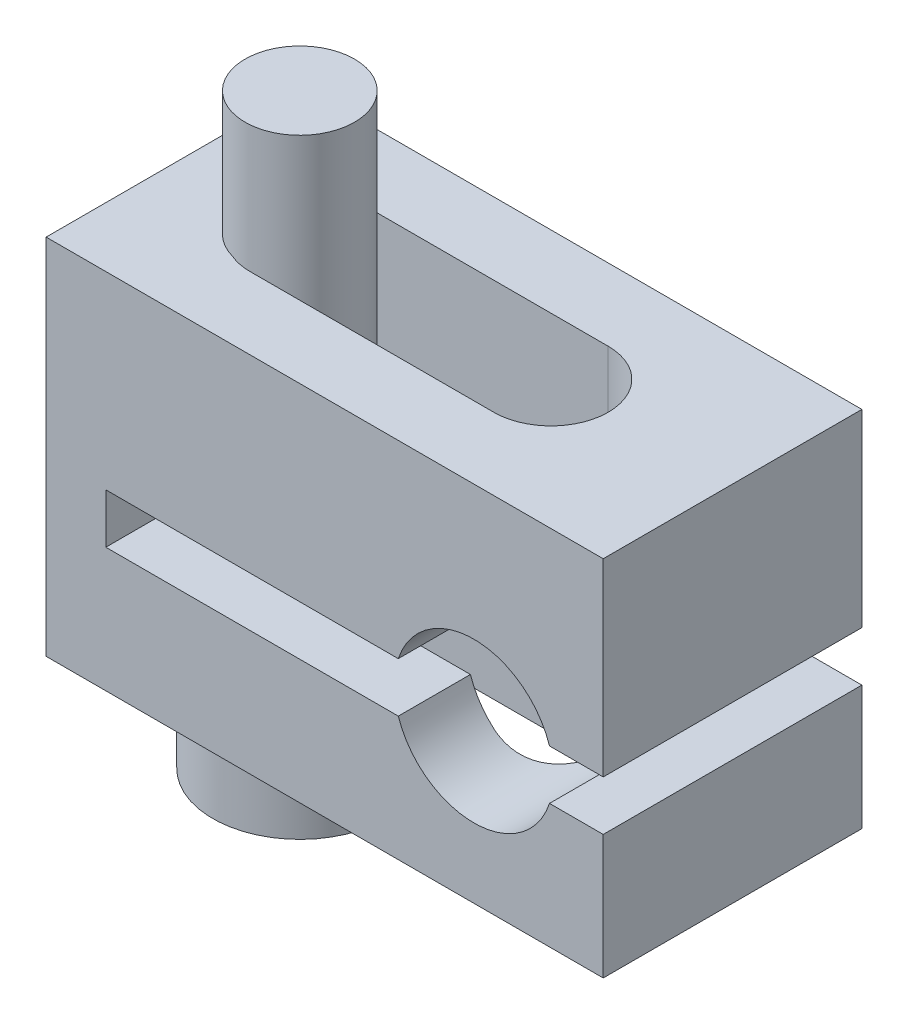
ISO-10303-21;
HEADER;
FILE_DESCRIPTION(('STEP AP214'),'2;1');
FILE_NAME('part.step','',(''),(''),'','','');
FILE_SCHEMA(('AUTOMOTIVE_DESIGN { 1 0 10303 214 1 1 1 1 }'));
ENDSEC;
DATA;
#1=APPLICATION_CONTEXT('core data for automotive mechanical design processes');
#2=APPLICATION_PROTOCOL_DEFINITION('international standard','automotive_design',2000,#1);
#3=PRODUCT_CONTEXT('',#1,'mechanical');
#4=PRODUCT('Part','Part','',(#3));
#5=PRODUCT_RELATED_PRODUCT_CATEGORY('part','',(#4));
#6=PRODUCT_DEFINITION_FORMATION('','',#4);
#7=PRODUCT_DEFINITION_CONTEXT('part definition',#1,'design');
#8=PRODUCT_DEFINITION('design','',#6,#7);
#9=PRODUCT_DEFINITION_SHAPE('','',#8);
#10=(LENGTH_UNIT() NAMED_UNIT(*) SI_UNIT(.MILLI.,.METRE.));
#11=(NAMED_UNIT(*) PLANE_ANGLE_UNIT() SI_UNIT($,.RADIAN.));
#12=(NAMED_UNIT(*) SI_UNIT($,.STERADIAN.) SOLID_ANGLE_UNIT());
#13=UNCERTAINTY_MEASURE_WITH_UNIT(LENGTH_MEASURE(1.E-05),#10,'distance_accuracy_value','');
#14=(GEOMETRIC_REPRESENTATION_CONTEXT(3) GLOBAL_UNCERTAINTY_ASSIGNED_CONTEXT((#13)) GLOBAL_UNIT_ASSIGNED_CONTEXT((#10,
#11,#12)) REPRESENTATION_CONTEXT('',''));
#15=CARTESIAN_POINT('',(0.,0.,0.));
#16=DIRECTION('',(0.,0.,1.));
#17=DIRECTION('',(1.,0.,0.));
#18=AXIS2_PLACEMENT_3D('',#15,#16,#17);
#19=CARTESIAN_POINT('',(2.47650000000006,4.318,-1.4605));
#20=DIRECTION('',(0.,0.,-1.));
#21=DIRECTION('',(-1.,0.,0.));
#22=AXIS2_PLACEMENT_3D('',#19,#20,#21);
#23=PLANE('',#22);
#24=CARTESIAN_POINT('',(3.81000000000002,-1.14300000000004,-1.46050000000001));
#25=DIRECTION('',(0.,0.,1.));
#26=DIRECTION('',(0.,-1.,0.));
#27=AXIS2_PLACEMENT_3D('',#24,#25,#26);
#28=CIRCLE('',#27,2.032);
#29=CARTESIAN_POINT('',(1.87976711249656,-0.507999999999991,-1.46050000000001));
#30=VERTEX_POINT('',#29);
#31=CARTESIAN_POINT('',(2.47650000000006,0.390232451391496,-1.4605));
#32=VERTEX_POINT('',#31);
#33=EDGE_CURVE('E365',#30,#32,#28,.F.);
#34=ORIENTED_EDGE('',*,*,#33,.T.);
#35=DIRECTION('',(0.,-1.,0.));
#36=VECTOR('',#35,1.);
#37=CARTESIAN_POINT('',(2.47650000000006,4.318,-1.46049999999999));
#38=LINE('',#37,#36);
#39=CARTESIAN_POINT('',(2.47650000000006,4.318,-1.4605));
#40=VERTEX_POINT('',#39);
#41=EDGE_CURVE('E206',#32,#40,#38,.F.);
#42=ORIENTED_EDGE('',*,*,#41,.T.);
#43=DIRECTION('',(1.,0.,0.));
#44=VECTOR('',#43,1.);
#45=CARTESIAN_POINT('',(-7.11199999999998,4.318,-1.4605));
#46=LINE('',#45,#44);
#47=CARTESIAN_POINT('',(-3.74649999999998,4.318,-1.4605));
#48=VERTEX_POINT('',#47);
#49=EDGE_CURVE('E439',#48,#40,#46,.T.);
#50=ORIENTED_EDGE('',*,*,#49,.F.);
#51=DIRECTION('',(0.,-1.,0.));
#52=VECTOR('',#51,1.);
#53=CARTESIAN_POINT('',(-3.74649999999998,4.318,-1.46049999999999));
#54=LINE('',#53,#52);
#55=CARTESIAN_POINT('',(-3.74649999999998,-0.507999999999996,-1.4605));
#56=VERTEX_POINT('',#55);
#57=EDGE_CURVE('E205',#48,#56,#54,.T.);
#58=ORIENTED_EDGE('',*,*,#57,.T.);
#59=DIRECTION('',(1.,0.,0.));
#60=VECTOR('',#59,1.);
#61=CARTESIAN_POINT('',(1.8797671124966,-0.507999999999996,-1.46050000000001));
#62=LINE('',#61,#60);
#63=EDGE_CURVE('E383',#30,#56,#62,.F.);
#64=ORIENTED_EDGE('',*,*,#63,.F.);
#65=EDGE_LOOP('',(#34,#42,#50,#58,#64));
#66=FACE_BOUND('',#65,.T.);
#67=ADVANCED_FACE('F17',(#66),#23,.F.);
#68=CARTESIAN_POINT('',(2.47650000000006,4.318,0.));
#69=DIRECTION('',(0.,-1.,0.));
#70=DIRECTION('',(0.,0.,-1.));
#71=AXIS2_PLACEMENT_3D('',#68,#69,#70);
#72=CYLINDRICAL_SURFACE('',#71,1.4605);
#73=CARTESIAN_POINT('',(2.47650000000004,0.390232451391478,-1.46049999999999));
#74=CARTESIAN_POINT('',(2.50555463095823,0.415509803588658,-1.46050207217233));
#75=CARTESIAN_POINT('',(2.53534390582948,0.439959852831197,-1.45963267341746));
#76=CARTESIAN_POINT('',(2.5962057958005,0.487093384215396,-1.45590518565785));
#77=CARTESIAN_POINT('',(2.62727943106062,0.509775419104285,-1.45304548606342));
#78=CARTESIAN_POINT('',(2.69055768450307,0.553275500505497,-1.44508061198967));
#79=CARTESIAN_POINT('',(2.72276500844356,0.57408859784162,-1.43996967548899));
#80=CARTESIAN_POINT('',(2.78792788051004,0.613658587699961,-1.4272972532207));
#81=CARTESIAN_POINT('',(2.82088321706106,0.632416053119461,-1.41973645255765));
#82=CARTESIAN_POINT('',(2.92077758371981,0.685657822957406,-1.3929913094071));
#83=CARTESIAN_POINT('',(2.98845267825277,0.716912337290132,-1.3697765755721));
#84=CARTESIAN_POINT('',(3.12226589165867,0.770437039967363,-1.31200058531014));
#85=CARTESIAN_POINT('',(3.18840724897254,0.792728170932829,-1.2774661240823));
#86=CARTESIAN_POINT('',(3.31096528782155,0.827717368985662,-1.20063972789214));
#87=CARTESIAN_POINT('',(3.36773641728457,0.841041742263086,-1.15919277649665));
#88=CARTESIAN_POINT('',(3.47531586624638,0.861999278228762,-1.06790025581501));
#89=CARTESIAN_POINT('',(3.5261185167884,0.869627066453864,-1.01804680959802));
#90=CARTESIAN_POINT('',(3.62132330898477,0.8808053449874,-0.909819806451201));
#91=CARTESIAN_POINT('',(3.66552285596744,0.884243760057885,-0.85125722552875));
#92=CARTESIAN_POINT('',(3.74469371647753,0.888338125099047,-0.728086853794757));
#93=CARTESIAN_POINT('',(3.7796598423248,0.888992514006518,-0.663475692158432));
#94=CARTESIAN_POINT('',(3.84207606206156,0.889008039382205,-0.524012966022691));
#95=CARTESIAN_POINT('',(3.86862564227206,0.888253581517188,-0.448758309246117));
#96=CARTESIAN_POINT('',(3.90908942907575,0.886684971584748,-0.29503320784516));
#97=CARTESIAN_POINT('',(3.92302794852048,0.885870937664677,-0.216569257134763));
#98=CARTESIAN_POINT('',(3.93266911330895,0.885294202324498,-0.114724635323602));
#99=CARTESIAN_POINT('',(3.93429216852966,0.885195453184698,-0.0918120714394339));
#100=CARTESIAN_POINT('',(3.93645805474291,0.885061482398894,-0.0459363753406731));
#101=CARTESIAN_POINT('',(3.93700090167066,0.885026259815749,-0.0229732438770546));
#102=CARTESIAN_POINT('',(3.93699678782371,0.885031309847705,0.0818370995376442));
#103=CARTESIAN_POINT('',(3.93009275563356,0.885496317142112,0.163791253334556));
#104=CARTESIAN_POINT('',(3.90263419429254,0.886932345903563,0.325508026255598));
#105=CARTESIAN_POINT('',(3.8820477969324,0.887904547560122,0.405265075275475));
#106=CARTESIAN_POINT('',(3.82779059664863,0.889102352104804,0.56017942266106));
#107=CARTESIAN_POINT('',(3.79412638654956,0.889328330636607,0.635339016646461));
#108=CARTESIAN_POINT('',(3.71468713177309,0.887150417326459,0.778895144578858));
#109=CARTESIAN_POINT('',(3.66891788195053,0.884747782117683,0.847294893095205));
#110=CARTESIAN_POINT('',(3.567476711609,0.875107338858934,0.974339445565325));
#111=CARTESIAN_POINT('',(3.51195828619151,0.867940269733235,1.03311151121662));
#112=CARTESIAN_POINT('',(3.39275684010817,0.846617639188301,1.1401462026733));
#113=CARTESIAN_POINT('',(3.32908137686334,0.832468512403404,1.18841844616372));
#114=CARTESIAN_POINT('',(3.20191282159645,0.7969105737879,1.26967310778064));
#115=CARTESIAN_POINT('',(3.13881598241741,0.776176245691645,1.30357226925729));
#116=CARTESIAN_POINT('',(3.01107667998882,0.726607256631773,1.3609518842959));
#117=CARTESIAN_POINT('',(2.94643403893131,0.697771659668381,1.38443113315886));
#118=CARTESIAN_POINT('',(2.82126685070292,0.633560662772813,1.42065551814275));
#119=CARTESIAN_POINT('',(2.76068635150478,0.598529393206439,1.43382802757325));
#120=CARTESIAN_POINT('',(2.64274771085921,0.521778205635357,1.45223333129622));
#121=CARTESIAN_POINT('',(2.58538662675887,0.480064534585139,1.45747349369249));
#122=CARTESIAN_POINT('',(2.51213255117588,0.420688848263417,1.46017998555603));
#123=CARTESIAN_POINT('',(2.49417615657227,0.405611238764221,1.46050185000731));
#124=CARTESIAN_POINT('',(2.47650000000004,0.390232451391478,1.46050000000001));
#125=B_SPLINE_CURVE_WITH_KNOTS('',3,(#73,#74,#75,#76,#77,#78,#79,#80,#81,#82,#83,#84,#85,#86,
#87,#88,#89,#90,#91,#92,#93,#94,#95,#96,#97,#98,#99,#100,#101,#102,#103,#104,#105,#106,#107,
#108,#109,#110,#111,#112,#113,#114,#115,#116,#117,#118,#119,#120,#121,#122,#123,#124),
.UNSPECIFIED.,.F.,.F.,(4,2,2,2,2,2,2,2,2,2,2,2,2,2,2,2,2,2,2,2,2,2,2,2,2,4),(0.,
0.11552441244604,0.231142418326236,0.347058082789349,0.462941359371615,0.69575898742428,
0.92802943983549,1.14165945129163,1.35549075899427,1.57492511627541,1.79448249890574,
2.03284914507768,2.27075525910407,2.33964860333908,2.40854093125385,2.65396781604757,
2.89996834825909,3.14584502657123,3.39160421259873,3.63379368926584,3.87576038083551,
4.09828962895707,4.3208445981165,4.53359358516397,4.74614483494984,4.81646215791),.UNSPECIFIED.);
#126=CARTESIAN_POINT('',(2.47650000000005,0.390232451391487,1.4605));
#127=VERTEX_POINT('',#126);
#128=EDGE_CURVE('E452',#32,#127,#125,.T.);
#129=ORIENTED_EDGE('',*,*,#128,.T.);
#130=DIRECTION('',(0.,1.,0.));
#131=VECTOR('',#130,1.);
#132=CARTESIAN_POINT('',(2.47650000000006,4.318,1.4605));
#133=LINE('',#132,#131);
#134=CARTESIAN_POINT('',(2.47650000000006,4.318,1.4605));
#135=VERTEX_POINT('',#134);
#136=EDGE_CURVE('E209',#127,#135,#133,.T.);
#137=ORIENTED_EDGE('',*,*,#136,.T.);
#138=CARTESIAN_POINT('',(2.47650000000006,4.318,0.));
#139=DIRECTION('',(0.,-1.,0.));
#140=DIRECTION('',(0.,0.,-1.));
#141=AXIS2_PLACEMENT_3D('',#138,#139,#140);
#142=CIRCLE('',#141,1.4605);
#143=EDGE_CURVE('E444',#40,#135,#142,.T.);
#144=ORIENTED_EDGE('',*,*,#143,.F.);
#145=ORIENTED_EDGE('',*,*,#41,.F.);
#146=EDGE_LOOP('',(#129,#137,#144,#145));
#147=FACE_BOUND('',#146,.T.);
#148=ADVANCED_FACE('F458',(#147),#72,.F.);
#149=CARTESIAN_POINT('',(-3.74649999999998,4.318,1.4605));
#150=DIRECTION('',(0.,0.,1.));
#151=DIRECTION('',(1.,0.,0.));
#152=AXIS2_PLACEMENT_3D('',#149,#150,#151);
#153=PLANE('',#152);
#154=DIRECTION('',(0.,-1.,0.));
#155=VECTOR('',#154,1.);
#156=CARTESIAN_POINT('',(-3.74649999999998,4.318,1.46050000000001));
#157=LINE('',#156,#155);
#158=CARTESIAN_POINT('',(-3.74649999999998,-0.507999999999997,1.4605));
#159=VERTEX_POINT('',#158);
#160=CARTESIAN_POINT('',(-3.74649999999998,4.318,1.46050000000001));
#161=VERTEX_POINT('',#160);
#162=EDGE_CURVE('E175',#159,#161,#157,.F.);
#163=ORIENTED_EDGE('',*,*,#162,.T.);
#164=DIRECTION('',(1.,0.,0.));
#165=VECTOR('',#164,1.);
#166=CARTESIAN_POINT('',(-7.11199999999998,4.318,1.4605));
#167=LINE('',#166,#165);
#168=EDGE_CURVE('E510',#135,#161,#167,.F.);
#169=ORIENTED_EDGE('',*,*,#168,.F.);
#170=ORIENTED_EDGE('',*,*,#136,.F.);
#171=CARTESIAN_POINT('',(3.81000000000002,-1.14300000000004,1.4605));
#172=DIRECTION('',(0.,0.,1.));
#173=DIRECTION('',(0.,-1.,0.));
#174=AXIS2_PLACEMENT_3D('',#171,#172,#173);
#175=CIRCLE('',#174,2.032);
#176=CARTESIAN_POINT('',(1.87976711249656,-0.50799999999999,1.4605));
#177=VERTEX_POINT('',#176);
#178=EDGE_CURVE('E415',#127,#177,#175,.T.);
#179=ORIENTED_EDGE('',*,*,#178,.T.);
#180=DIRECTION('',(1.,0.,0.));
#181=VECTOR('',#180,1.);
#182=CARTESIAN_POINT('',(1.8797671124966,-0.507999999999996,1.4605));
#183=LINE('',#182,#181);
#184=EDGE_CURVE('E179',#159,#177,#183,.T.);
#185=ORIENTED_EDGE('',*,*,#184,.F.);
#186=EDGE_LOOP('',(#163,#169,#170,#179,#185));
#187=FACE_BOUND('',#186,.T.);
#188=ADVANCED_FACE('F927',(#187),#153,.F.);
#189=CARTESIAN_POINT('',(-3.74649999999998,4.318,0.));
#190=DIRECTION('',(0.,-1.,0.));
#191=DIRECTION('',(0.,0.,-1.));
#192=AXIS2_PLACEMENT_3D('',#189,#190,#191);
#193=CYLINDRICAL_SURFACE('',#192,1.4605);
#194=CARTESIAN_POINT('',(-3.74649999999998,-0.507999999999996,0.));
#195=DIRECTION('',(0.,-1.,0.));
#196=DIRECTION('',(0.,0.,-1.));
#197=AXIS2_PLACEMENT_3D('',#194,#195,#196);
#198=CIRCLE('',#197,1.4605);
#199=CARTESIAN_POINT('',(-4.31800000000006,-0.507999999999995,-1.34404166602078));
#200=VERTEX_POINT('',#199);
#201=EDGE_CURVE('E185',#56,#200,#198,.F.);
#202=ORIENTED_EDGE('',*,*,#201,.F.);
#203=ORIENTED_EDGE('',*,*,#57,.F.);
#204=CARTESIAN_POINT('',(-3.74649999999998,4.318,0.));
#205=DIRECTION('',(0.,-1.,0.));
#206=DIRECTION('',(0.,0.,-1.));
#207=AXIS2_PLACEMENT_3D('',#204,#205,#206);
#208=CIRCLE('',#207,1.4605);
#209=CARTESIAN_POINT('',(-4.31800000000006,4.318,-1.34404166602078));
#210=VERTEX_POINT('',#209);
#211=EDGE_CURVE('E432',#210,#48,#208,.T.);
#212=ORIENTED_EDGE('',*,*,#211,.F.);
#213=DIRECTION('',(0.,-1.,0.));
#214=VECTOR('',#213,1.);
#215=CARTESIAN_POINT('',(-4.31800000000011,7.49299999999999,-1.34404166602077));
#216=LINE('',#215,#214);
#217=EDGE_CURVE('E201',#200,#210,#216,.F.);
#218=ORIENTED_EDGE('',*,*,#217,.F.);
#219=EDGE_LOOP('',(#202,#203,#212,#218));
#220=FACE_BOUND('',#219,.T.);
#221=ADVANCED_FACE('F938',(#220),#193,.F.);
#222=CARTESIAN_POINT('',(-3.80999999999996,7.49299999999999,0.));
#223=DIRECTION('',(0.,1.,0.));
#224=DIRECTION('',(0.,0.,1.));
#225=AXIS2_PLACEMENT_3D('',#222,#223,#224);
#226=PLANE('',#225);
#227=CARTESIAN_POINT('',(-3.93699999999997,7.49299999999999,0.));
#228=DIRECTION('',(0.,-1.,0.));
#229=DIRECTION('',(0.,0.,-1.));
#230=AXIS2_PLACEMENT_3D('',#227,#228,#229);
#231=CIRCLE('',#230,1.397);
#232=CARTESIAN_POINT('',(-3.93699999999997,7.49299999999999,-1.39699999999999));
#233=VERTEX_POINT('',#232);
#234=EDGE_CURVE('E195',#233,#233,#231,.T.);
#235=ORIENTED_EDGE('',*,*,#234,.F.);
#236=EDGE_LOOP('',(#235));
#237=FACE_BOUND('',#236,.T.);
#238=ADVANCED_FACE('F948',(#237),#226,.T.);
#239=CARTESIAN_POINT('',(-3.74649999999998,4.318,0.));
#240=DIRECTION('',(0.,-1.,0.));
#241=DIRECTION('',(0.,0.,-1.));
#242=AXIS2_PLACEMENT_3D('',#239,#240,#241);
#243=CYLINDRICAL_SURFACE('',#242,1.4605);
#244=CARTESIAN_POINT('',(-3.74649999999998,4.318,0.));
#245=DIRECTION('',(0.,-1.,0.));
#246=DIRECTION('',(0.,0.,-1.));
#247=AXIS2_PLACEMENT_3D('',#244,#245,#246);
#248=CIRCLE('',#247,1.4605);
#249=CARTESIAN_POINT('',(-4.31800000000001,4.318,1.34404166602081));
#250=VERTEX_POINT('',#249);
#251=EDGE_CURVE('E395',#161,#250,#248,.T.);
#252=ORIENTED_EDGE('',*,*,#251,.F.);
#253=ORIENTED_EDGE('',*,*,#162,.F.);
#254=CARTESIAN_POINT('',(-3.74649999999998,-0.507999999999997,0.));
#255=DIRECTION('',(0.,-1.,0.));
#256=DIRECTION('',(0.,0.,-1.));
#257=AXIS2_PLACEMENT_3D('',#254,#255,#256);
#258=CIRCLE('',#257,1.4605);
#259=CARTESIAN_POINT('',(-4.31800000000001,-0.507999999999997,1.3440416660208));
#260=VERTEX_POINT('',#259);
#261=EDGE_CURVE('E21',#260,#159,#258,.F.);
#262=ORIENTED_EDGE('',*,*,#261,.F.);
#263=DIRECTION('',(0.,-1.,0.));
#264=VECTOR('',#263,1.);
#265=CARTESIAN_POINT('',(-4.31800000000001,7.49299999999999,1.34404166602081));
#266=LINE('',#265,#264);
#267=EDGE_CURVE('E173',#250,#260,#266,.T.);
#268=ORIENTED_EDGE('',*,*,#267,.F.);
#269=EDGE_LOOP('',(#252,#253,#262,#268));
#270=FACE_BOUND('',#269,.T.);
#271=ADVANCED_FACE('F171',(#270),#243,.F.);
#272=CARTESIAN_POINT('',(-5.58800000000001,-0.507999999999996,-3.302));
#273=DIRECTION('',(1.,0.,0.));
#274=DIRECTION('',(0.,0.,-1.));
#275=AXIS2_PLACEMENT_3D('',#272,#273,#274);
#276=PLANE('',#275);
#277=DIRECTION('',(0.,1.,0.));
#278=VECTOR('',#277,1.);
#279=CARTESIAN_POINT('',(-5.58800000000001,-0.624782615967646,-3.302));
#280=LINE('',#279,#278);
#281=CARTESIAN_POINT('',(-5.58800000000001,-1.77800000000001,-3.302));
#282=VERTEX_POINT('',#281);
#283=CARTESIAN_POINT('',(-5.58800000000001,-0.507999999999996,-3.302));
#284=VERTEX_POINT('',#283);
#285=EDGE_CURVE('E386',#282,#284,#280,.T.);
#286=ORIENTED_EDGE('',*,*,#285,.T.);
#287=DIRECTION('',(0.,0.,-1.));
#288=VECTOR('',#287,1.);
#289=CARTESIAN_POINT('',(-5.58800000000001,-0.507999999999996,-3.302));
#290=LINE('',#289,#288);
#291=CARTESIAN_POINT('',(-5.58800000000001,-0.507999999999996,3.30199999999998));
#292=VERTEX_POINT('',#291);
#293=EDGE_CURVE('E380',#292,#284,#290,.T.);
#294=ORIENTED_EDGE('',*,*,#293,.F.);
#295=DIRECTION('',(0.,1.,0.));
#296=VECTOR('',#295,1.);
#297=CARTESIAN_POINT('',(-5.58800000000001,-0.624782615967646,3.30199999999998));
#298=LINE('',#297,#296);
#299=CARTESIAN_POINT('',(-5.58800000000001,-1.77800000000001,3.30199999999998));
#300=VERTEX_POINT('',#299);
#301=EDGE_CURVE('E416',#300,#292,#298,.T.);
#302=ORIENTED_EDGE('',*,*,#301,.F.);
#303=DIRECTION('',(0.,0.,1.));
#304=VECTOR('',#303,1.);
#305=CARTESIAN_POINT('',(-5.58800000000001,-1.77800000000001,-3.302));
#306=LINE('',#305,#304);
#307=EDGE_CURVE('E358',#282,#300,#306,.T.);
#308=ORIENTED_EDGE('',*,*,#307,.F.);
#309=EDGE_LOOP('',(#286,#294,#302,#308));
#310=FACE_BOUND('',#309,.T.);
#311=ADVANCED_FACE('F654',(#310),#276,.T.);
#312=CARTESIAN_POINT('',(1.8797671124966,-0.507999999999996,-3.302));
#313=DIRECTION('',(0.,-1.,0.));
#314=DIRECTION('',(0.,0.,-1.));
#315=AXIS2_PLACEMENT_3D('',#312,#313,#314);
#316=PLANE('',#315);
#317=ORIENTED_EDGE('',*,*,#201,.T.);
#318=CARTESIAN_POINT('',(-3.93699999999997,-0.507999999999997,0.));
#319=DIRECTION('',(0.,-1.,0.));
#320=DIRECTION('',(0.,0.,-1.));
#321=AXIS2_PLACEMENT_3D('',#318,#319,#320);
#322=CIRCLE('',#321,1.397);
#323=EDGE_CURVE('E181',#260,#200,#322,.T.);
#324=ORIENTED_EDGE('',*,*,#323,.F.);
#325=ORIENTED_EDGE('',*,*,#261,.T.);
#326=ORIENTED_EDGE('',*,*,#184,.T.);
#327=DIRECTION('',(0.,0.,1.));
#328=VECTOR('',#327,1.);
#329=CARTESIAN_POINT('',(1.87976711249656,-0.507999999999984,-3.302));
#330=LINE('',#329,#328);
#331=CARTESIAN_POINT('',(1.87976711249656,-0.507999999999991,3.30199999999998));
#332=VERTEX_POINT('',#331);
#333=EDGE_CURVE('E379',#177,#332,#330,.T.);
#334=ORIENTED_EDGE('',*,*,#333,.T.);
#335=DIRECTION('',(1.,0.,0.));
#336=VECTOR('',#335,1.);
#337=CARTESIAN_POINT('',(0.168472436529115,-0.507999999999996,3.30199999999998));
#338=LINE('',#337,#336);
#339=EDGE_CURVE('E419',#292,#332,#338,.T.);
#340=ORIENTED_EDGE('',*,*,#339,.F.);
#341=ORIENTED_EDGE('',*,*,#293,.T.);
#342=DIRECTION('',(1.,0.,0.));
#343=VECTOR('',#342,1.);
#344=CARTESIAN_POINT('',(0.168472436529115,-0.507999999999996,-3.302));
#345=LINE('',#344,#343);
#346=CARTESIAN_POINT('',(1.87976711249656,-0.50799999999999,-3.302));
#347=VERTEX_POINT('',#346);
#348=EDGE_CURVE('E389',#284,#347,#345,.T.);
#349=ORIENTED_EDGE('',*,*,#348,.T.);
#350=DIRECTION('',(0.,0.,1.));
#351=VECTOR('',#350,1.);
#352=CARTESIAN_POINT('',(1.87976711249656,-0.507999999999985,-3.302));
#353=LINE('',#352,#351);
#354=EDGE_CURVE('E376',#347,#30,#353,.T.);
#355=ORIENTED_EDGE('',*,*,#354,.T.);
#356=ORIENTED_EDGE('',*,*,#63,.T.);
#357=EDGE_LOOP('',(#317,#324,#325,#326,#334,#340,#341,#349,#355,#356));
#358=FACE_BOUND('',#357,.T.);
#359=ADVANCED_FACE('F182',(#358),#316,.T.);
#360=CARTESIAN_POINT('',(3.81000000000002,-1.14300000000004,-3.302));
#361=DIRECTION('',(0.,0.,1.));
#362=DIRECTION('',(0.,-1.,0.));
#363=AXIS2_PLACEMENT_3D('',#360,#361,#362);
#364=CYLINDRICAL_SURFACE('',#363,2.032);
#365=ORIENTED_EDGE('',*,*,#354,.F.);
#366=CARTESIAN_POINT('',(3.81000000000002,-1.14300000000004,-3.302));
#367=DIRECTION('',(0.,0.,1.));
#368=DIRECTION('',(0.,-1.,0.));
#369=AXIS2_PLACEMENT_3D('',#366,#367,#368);
#370=CIRCLE('',#369,2.032);
#371=CARTESIAN_POINT('',(5.74023288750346,-0.507999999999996,-3.302));
#372=VERTEX_POINT('',#371);
#373=EDGE_CURVE('E546',#347,#372,#370,.F.);
#374=ORIENTED_EDGE('',*,*,#373,.T.);
#375=DIRECTION('',(0.,0.,-1.));
#376=VECTOR('',#375,1.);
#377=CARTESIAN_POINT('',(5.74023288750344,-0.507999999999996,-3.302));
#378=LINE('',#377,#376);
#379=CARTESIAN_POINT('',(5.74023288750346,-0.507999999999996,3.30199999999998));
#380=VERTEX_POINT('',#379);
#381=EDGE_CURVE('E361',#380,#372,#378,.T.);
#382=ORIENTED_EDGE('',*,*,#381,.F.);
#383=CARTESIAN_POINT('',(3.81000000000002,-1.14300000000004,3.30199999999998));
#384=DIRECTION('',(0.,0.,1.));
#385=DIRECTION('',(0.,-1.,0.));
#386=AXIS2_PLACEMENT_3D('',#383,#384,#385);
#387=CIRCLE('',#386,2.032);
#388=EDGE_CURVE('E522',#332,#380,#387,.F.);
#389=ORIENTED_EDGE('',*,*,#388,.F.);
#390=ORIENTED_EDGE('',*,*,#333,.F.);
#391=ORIENTED_EDGE('',*,*,#178,.F.);
#392=ORIENTED_EDGE('',*,*,#128,.F.);
#393=ORIENTED_EDGE('',*,*,#33,.F.);
#394=EDGE_LOOP('',(#365,#374,#382,#389,#390,#391,#392,#393));
#395=FACE_BOUND('',#394,.T.);
#396=ADVANCED_FACE('F462',(#395),#364,.F.);
#397=CARTESIAN_POINT('',(7.11199999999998,-0.507999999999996,-3.302));
#398=DIRECTION('',(0.,-1.,0.));
#399=DIRECTION('',(0.,0.,-1.));
#400=AXIS2_PLACEMENT_3D('',#397,#398,#399);
#401=PLANE('',#400);
#402=DIRECTION('',(1.,0.,0.));
#403=VECTOR('',#402,1.);
#404=CARTESIAN_POINT('',(0.168472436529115,-0.507999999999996,-3.302));
#405=LINE('',#404,#403);
#406=CARTESIAN_POINT('',(7.11199999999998,-0.507999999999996,-3.302));
#407=VERTEX_POINT('',#406);
#408=EDGE_CURVE('E373',#372,#407,#405,.T.);
#409=ORIENTED_EDGE('',*,*,#408,.T.);
#410=DIRECTION('',(0.,0.,-1.));
#411=VECTOR('',#410,1.);
#412=CARTESIAN_POINT('',(7.11199999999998,-0.507999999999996,-3.30199999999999));
#413=LINE('',#412,#411);
#414=CARTESIAN_POINT('',(7.11199999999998,-0.507999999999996,3.30199999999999));
#415=VERTEX_POINT('',#414);
#416=EDGE_CURVE('E364',#415,#407,#413,.T.);
#417=ORIENTED_EDGE('',*,*,#416,.F.);
#418=DIRECTION('',(1.,0.,0.));
#419=VECTOR('',#418,1.);
#420=CARTESIAN_POINT('',(0.168472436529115,-0.507999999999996,3.30199999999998));
#421=LINE('',#420,#419);
#422=EDGE_CURVE('E518',#380,#415,#421,.T.);
#423=ORIENTED_EDGE('',*,*,#422,.F.);
#424=ORIENTED_EDGE('',*,*,#381,.T.);
#425=EDGE_LOOP('',(#409,#417,#423,#424));
#426=FACE_BOUND('',#425,.T.);
#427=ADVANCED_FACE('F467',(#426),#401,.T.);
#428=CARTESIAN_POINT('',(7.11199999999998,4.318,-3.30199999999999));
#429=DIRECTION('',(1.,0.,0.));
#430=DIRECTION('',(0.,0.,-1.));
#431=AXIS2_PLACEMENT_3D('',#428,#429,#430);
#432=PLANE('',#431);
#433=DIRECTION('',(0.,1.,0.));
#434=VECTOR('',#433,1.);
#435=CARTESIAN_POINT('',(7.11199999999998,-0.624782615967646,-3.302));
#436=LINE('',#435,#434);
#437=CARTESIAN_POINT('',(7.11199999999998,4.318,-3.302));
#438=VERTEX_POINT('',#437);
#439=EDGE_CURVE('E215',#407,#438,#436,.T.);
#440=ORIENTED_EDGE('',*,*,#439,.T.);
#441=DIRECTION('',(0.,0.,1.));
#442=VECTOR('',#441,1.);
#443=CARTESIAN_POINT('',(7.11199999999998,4.318,-3.30199999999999));
#444=LINE('',#443,#442);
#445=CARTESIAN_POINT('',(7.11199999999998,4.318,3.30199999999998));
#446=VERTEX_POINT('',#445);
#447=EDGE_CURVE('E368',#446,#438,#444,.F.);
#448=ORIENTED_EDGE('',*,*,#447,.F.);
#449=DIRECTION('',(0.,1.,0.));
#450=VECTOR('',#449,1.);
#451=CARTESIAN_POINT('',(7.11199999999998,-0.624782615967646,3.30199999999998));
#452=LINE('',#451,#450);
#453=EDGE_CURVE('E347',#415,#446,#452,.T.);
#454=ORIENTED_EDGE('',*,*,#453,.F.);
#455=ORIENTED_EDGE('',*,*,#416,.T.);
#456=EDGE_LOOP('',(#440,#448,#454,#455));
#457=FACE_BOUND('',#456,.T.);
#458=ADVANCED_FACE('F472',(#457),#432,.T.);
#459=CARTESIAN_POINT('',(-7.11199999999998,4.318,-3.30199999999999));
#460=DIRECTION('',(0.,1.,0.));
#461=DIRECTION('',(0.,0.,1.));
#462=AXIS2_PLACEMENT_3D('',#459,#460,#461);
#463=PLANE('',#462);
#464=ORIENTED_EDGE('',*,*,#251,.T.);
#465=CARTESIAN_POINT('',(-3.93699999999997,4.318,0.));
#466=DIRECTION('',(0.,-1.,0.));
#467=DIRECTION('',(0.,0.,-1.));
#468=AXIS2_PLACEMENT_3D('',#465,#466,#467);
#469=CIRCLE('',#468,1.397);
#470=EDGE_CURVE('E193',#210,#250,#469,.F.);
#471=ORIENTED_EDGE('',*,*,#470,.F.);
#472=ORIENTED_EDGE('',*,*,#211,.T.);
#473=ORIENTED_EDGE('',*,*,#49,.T.);
#474=ORIENTED_EDGE('',*,*,#143,.T.);
#475=ORIENTED_EDGE('',*,*,#168,.T.);
#476=EDGE_LOOP('',(#464,#471,#472,#473,#474,#475));
#477=FACE_BOUND('',#476,.T.);
#478=DIRECTION('',(1.,0.,0.));
#479=VECTOR('',#478,1.);
#480=CARTESIAN_POINT('',(0.168472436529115,4.318,-3.302));
#481=LINE('',#480,#479);
#482=CARTESIAN_POINT('',(-7.11199999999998,4.318,-3.302));
#483=VERTEX_POINT('',#482);
#484=EDGE_CURVE('E211',#438,#483,#481,.F.);
#485=ORIENTED_EDGE('',*,*,#484,.T.);
#486=DIRECTION('',(0.,0.,1.));
#487=VECTOR('',#486,1.);
#488=CARTESIAN_POINT('',(-7.11199999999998,4.318,-3.302));
#489=LINE('',#488,#487);
#490=CARTESIAN_POINT('',(-7.11199999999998,4.318,3.30199999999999));
#491=VERTEX_POINT('',#490);
#492=EDGE_CURVE('E538',#491,#483,#489,.F.);
#493=ORIENTED_EDGE('',*,*,#492,.F.);
#494=DIRECTION('',(1.,0.,0.));
#495=VECTOR('',#494,1.);
#496=CARTESIAN_POINT('',(0.168472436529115,4.318,3.30199999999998));
#497=LINE('',#496,#495);
#498=EDGE_CURVE('E411',#446,#491,#497,.F.);
#499=ORIENTED_EDGE('',*,*,#498,.F.);
#500=ORIENTED_EDGE('',*,*,#447,.T.);
#501=EDGE_LOOP('',(#485,#493,#499,#500));
#502=FACE_BOUND('',#501,.T.);
#503=ADVANCED_FACE('F476',(#477,#502),#463,.T.);
#504=CARTESIAN_POINT('',(5.74023288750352,-1.77800000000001,-3.302));
#505=DIRECTION('',(0.,1.,0.));
#506=DIRECTION('',(0.,0.,1.));
#507=AXIS2_PLACEMENT_3D('',#504,#505,#506);
#508=PLANE('',#507);
#509=DIRECTION('',(1.,0.,0.));
#510=VECTOR('',#509,1.);
#511=CARTESIAN_POINT('',(0.168472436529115,-1.77800000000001,-3.302));
#512=LINE('',#511,#510);
#513=CARTESIAN_POINT('',(7.11199999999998,-1.77800000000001,-3.302));
#514=VERTEX_POINT('',#513);
#515=CARTESIAN_POINT('',(5.7402328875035,-1.778,-3.302));
#516=VERTEX_POINT('',#515);
#517=EDGE_CURVE('E557',#514,#516,#512,.F.);
#518=ORIENTED_EDGE('',*,*,#517,.T.);
#519=DIRECTION('',(0.,0.,1.));
#520=VECTOR('',#519,1.);
#521=CARTESIAN_POINT('',(5.74023288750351,-1.778,-3.302));
#522=LINE('',#521,#520);
#523=CARTESIAN_POINT('',(5.7402328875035,-1.778,3.30199999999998));
#524=VERTEX_POINT('',#523);
#525=EDGE_CURVE('E357',#516,#524,#522,.T.);
#526=ORIENTED_EDGE('',*,*,#525,.T.);
#527=DIRECTION('',(1.,0.,0.));
#528=VECTOR('',#527,1.);
#529=CARTESIAN_POINT('',(0.168472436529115,-1.77800000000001,3.30199999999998));
#530=LINE('',#529,#528);
#531=CARTESIAN_POINT('',(7.11199999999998,-1.77800000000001,3.30199999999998));
#532=VERTEX_POINT('',#531);
#533=EDGE_CURVE('E429',#532,#524,#530,.F.);
#534=ORIENTED_EDGE('',*,*,#533,.F.);
#535=DIRECTION('',(0.,0.,-1.));
#536=VECTOR('',#535,1.);
#537=CARTESIAN_POINT('',(7.11199999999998,-1.77800000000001,-3.302));
#538=LINE('',#537,#536);
#539=EDGE_CURVE('E399',#514,#532,#538,.F.);
#540=ORIENTED_EDGE('',*,*,#539,.F.);
#541=EDGE_LOOP('',(#518,#526,#534,#540));
#542=FACE_BOUND('',#541,.T.);
#543=ADVANCED_FACE('F480',(#542),#508,.T.);
#544=CARTESIAN_POINT('',(-5.58800000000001,-1.77800000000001,-3.302));
#545=DIRECTION('',(0.,1.,0.));
#546=DIRECTION('',(0.,0.,1.));
#547=AXIS2_PLACEMENT_3D('',#544,#545,#546);
#548=PLANE('',#547);
#549=CARTESIAN_POINT('',(-3.74649999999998,-1.77800000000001,0.));
#550=DIRECTION('',(0.,-1.,0.));
#551=DIRECTION('',(0.,0.,-1.));
#552=AXIS2_PLACEMENT_3D('',#549,#550,#551);
#553=CIRCLE('',#552,1.4605);
#554=CARTESIAN_POINT('',(-3.74649999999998,-1.77800000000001,1.4605));
#555=VERTEX_POINT('',#554);
#556=CARTESIAN_POINT('',(-4.31799999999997,-1.77800000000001,1.34404166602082));
#557=VERTEX_POINT('',#556);
#558=EDGE_CURVE('E348',#555,#557,#553,.T.);
#559=ORIENTED_EDGE('',*,*,#558,.T.);
#560=CARTESIAN_POINT('',(-3.93699999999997,-1.77800000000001,0.));
#561=DIRECTION('',(0.,-1.,0.));
#562=DIRECTION('',(0.,0.,-1.));
#563=AXIS2_PLACEMENT_3D('',#560,#561,#562);
#564=CIRCLE('',#563,1.397);
#565=CARTESIAN_POINT('',(-4.31799999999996,-1.77800000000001,-1.34404166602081));
#566=VERTEX_POINT('',#565);
#567=EDGE_CURVE('E189',#566,#557,#564,.F.);
#568=ORIENTED_EDGE('',*,*,#567,.F.);
#569=CARTESIAN_POINT('',(-3.74649999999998,-1.77800000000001,0.));
#570=DIRECTION('',(0.,-1.,0.));
#571=DIRECTION('',(0.,0.,-1.));
#572=AXIS2_PLACEMENT_3D('',#569,#570,#571);
#573=CIRCLE('',#572,1.4605);
#574=CARTESIAN_POINT('',(-3.74649999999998,-1.77800000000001,-1.4605));
#575=VERTEX_POINT('',#574);
#576=EDGE_CURVE('E351',#566,#575,#573,.T.);
#577=ORIENTED_EDGE('',*,*,#576,.T.);
#578=DIRECTION('',(-1.,0.,0.));
#579=VECTOR('',#578,1.);
#580=CARTESIAN_POINT('',(2.47650000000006,-1.77800000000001,-1.4605));
#581=LINE('',#580,#579);
#582=CARTESIAN_POINT('',(1.87976711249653,-1.778,-1.46050000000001));
#583=VERTEX_POINT('',#582);
#584=EDGE_CURVE('E243',#575,#583,#581,.F.);
#585=ORIENTED_EDGE('',*,*,#584,.T.);
#586=DIRECTION('',(0.,0.,1.));
#587=VECTOR('',#586,1.);
#588=CARTESIAN_POINT('',(1.87976711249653,-1.778,-3.302));
#589=LINE('',#588,#587);
#590=CARTESIAN_POINT('',(1.87976711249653,-1.778,-3.302));
#591=VERTEX_POINT('',#590);
#592=EDGE_CURVE('E355',#583,#591,#589,.F.);
#593=ORIENTED_EDGE('',*,*,#592,.T.);
#594=DIRECTION('',(1.,0.,0.));
#595=VECTOR('',#594,1.);
#596=CARTESIAN_POINT('',(0.168472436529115,-1.77800000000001,-3.302));
#597=LINE('',#596,#595);
#598=EDGE_CURVE('E390',#591,#282,#597,.F.);
#599=ORIENTED_EDGE('',*,*,#598,.T.);
#600=ORIENTED_EDGE('',*,*,#307,.T.);
#601=DIRECTION('',(1.,0.,0.));
#602=VECTOR('',#601,1.);
#603=CARTESIAN_POINT('',(0.168472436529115,-1.77800000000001,3.30199999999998));
#604=LINE('',#603,#602);
#605=CARTESIAN_POINT('',(1.87976711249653,-1.778,3.30199999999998));
#606=VERTEX_POINT('',#605);
#607=EDGE_CURVE('E420',#606,#300,#604,.F.);
#608=ORIENTED_EDGE('',*,*,#607,.F.);
#609=DIRECTION('',(0.,0.,1.));
#610=VECTOR('',#609,1.);
#611=CARTESIAN_POINT('',(1.87976711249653,-1.778,-3.302));
#612=LINE('',#611,#610);
#613=CARTESIAN_POINT('',(1.87976711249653,-1.778,1.4605));
#614=VERTEX_POINT('',#613);
#615=EDGE_CURVE('E359',#606,#614,#612,.F.);
#616=ORIENTED_EDGE('',*,*,#615,.T.);
#617=DIRECTION('',(1.,0.,0.));
#618=VECTOR('',#617,1.);
#619=CARTESIAN_POINT('',(-3.74649999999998,-1.77800000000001,1.4605));
#620=LINE('',#619,#618);
#621=EDGE_CURVE('E344',#614,#555,#620,.F.);
#622=ORIENTED_EDGE('',*,*,#621,.T.);
#623=EDGE_LOOP('',(#559,#568,#577,#585,#593,#599,#600,#608,#616,#622));
#624=FACE_BOUND('',#623,.T.);
#625=ADVANCED_FACE('F482',(#624),#548,.T.);
#626=CARTESIAN_POINT('',(3.81000000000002,-1.14300000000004,-3.302));
#627=DIRECTION('',(0.,0.,1.));
#628=DIRECTION('',(0.,-1.,0.));
#629=AXIS2_PLACEMENT_3D('',#626,#627,#628);
#630=CYLINDRICAL_SURFACE('',#629,2.032);
#631=ORIENTED_EDGE('',*,*,#615,.F.);
#632=CARTESIAN_POINT('',(3.81000000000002,-1.14300000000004,3.30199999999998));
#633=DIRECTION('',(0.,0.,1.));
#634=DIRECTION('',(0.,-1.,0.));
#635=AXIS2_PLACEMENT_3D('',#632,#633,#634);
#636=CIRCLE('',#635,2.032);
#637=EDGE_CURVE('E531',#524,#606,#636,.F.);
#638=ORIENTED_EDGE('',*,*,#637,.F.);
#639=ORIENTED_EDGE('',*,*,#525,.F.);
#640=CARTESIAN_POINT('',(3.81000000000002,-1.14300000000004,-3.302));
#641=DIRECTION('',(0.,0.,1.));
#642=DIRECTION('',(0.,-1.,0.));
#643=AXIS2_PLACEMENT_3D('',#640,#641,#642);
#644=CIRCLE('',#643,2.032);
#645=EDGE_CURVE('E554',#516,#591,#644,.F.);
#646=ORIENTED_EDGE('',*,*,#645,.T.);
#647=ORIENTED_EDGE('',*,*,#592,.F.);
#648=CARTESIAN_POINT('',(3.81000000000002,-1.14300000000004,-1.46050000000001));
#649=DIRECTION('',(0.,0.,1.));
#650=DIRECTION('',(0.,-1.,0.));
#651=AXIS2_PLACEMENT_3D('',#648,#649,#650);
#652=CIRCLE('',#651,2.032);
#653=CARTESIAN_POINT('',(2.47650000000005,-2.67623245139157,-1.4605));
#654=VERTEX_POINT('',#653);
#655=EDGE_CURVE('E239',#583,#654,#652,.T.);
#656=ORIENTED_EDGE('',*,*,#655,.T.);
#657=CARTESIAN_POINT('',(2.47650000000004,-2.67623245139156,-1.46049999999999));
#658=CARTESIAN_POINT('',(2.50555463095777,-2.70150980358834,-1.46050207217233));
#659=CARTESIAN_POINT('',(2.53534390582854,-2.72595985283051,-1.45963267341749));
#660=CARTESIAN_POINT('',(2.59620579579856,-2.77309338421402,-1.455905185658));
#661=CARTESIAN_POINT('',(2.62727943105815,-2.79577541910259,-1.45304548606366));
#662=CARTESIAN_POINT('',(2.69055768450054,-2.83927550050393,-1.44508061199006));
#663=CARTESIAN_POINT('',(2.72276500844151,-2.86008859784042,-1.43996967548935));
#664=CARTESIAN_POINT('',(2.787927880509,-2.89965858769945,-1.42729725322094));
#665=CARTESIAN_POINT('',(2.82088321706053,-2.91841605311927,-1.41973645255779));
#666=CARTESIAN_POINT('',(2.92077758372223,-2.97165782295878,-1.39299130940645));
#667=CARTESIAN_POINT('',(2.98845267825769,-3.00291233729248,-1.36977657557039));
#668=CARTESIAN_POINT('',(3.12226589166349,-3.05643703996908,-1.31200058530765));
#669=CARTESIAN_POINT('',(3.18840724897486,-3.07872817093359,-1.27746612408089));
#670=CARTESIAN_POINT('',(3.31096528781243,-3.11371736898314,-1.20063972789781));
#671=CARTESIAN_POINT('',(3.36773641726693,-3.12704174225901,-1.15919277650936));
#672=CARTESIAN_POINT('',(3.47531586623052,-3.14799927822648,-1.06790025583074));
#673=CARTESIAN_POINT('',(3.52611851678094,-3.15562706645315,-1.01804680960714));
#674=CARTESIAN_POINT('',(3.62132330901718,-3.16680534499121,-0.909819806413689));
#675=CARTESIAN_POINT('',(3.66552285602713,-3.17024376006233,-0.85125722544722));
#676=CARTESIAN_POINT('',(3.74469371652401,-3.17433812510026,-0.728086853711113));
#677=CARTESIAN_POINT('',(3.77965984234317,-3.17499251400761,-0.663475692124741));
#678=CARTESIAN_POINT('',(3.84207606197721,-3.17500803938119,-0.5240129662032));
#679=CARTESIAN_POINT('',(3.8686256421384,-3.17425358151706,-0.448758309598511));
#680=CARTESIAN_POINT('',(3.90908942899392,-3.17268497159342,-0.295033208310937));
#681=CARTESIAN_POINT('',(3.92302794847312,-3.17187093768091,-0.216569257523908));
#682=CARTESIAN_POINT('',(3.93266912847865,-3.17129420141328,-0.11472447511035));
#683=CARTESIAN_POINT('',(3.9342921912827,-3.17119545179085,-0.0918117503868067));
#684=CARTESIAN_POINT('',(3.93645807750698,-3.17106148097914,-0.0459357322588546));
#685=CARTESIAN_POINT('',(3.93700091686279,-3.17102625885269,-0.0229724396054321));
#686=CARTESIAN_POINT('',(3.93699673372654,-3.17103131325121,0.0818380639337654));
#687=CARTESIAN_POINT('',(3.93009264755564,-3.17149632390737,0.163792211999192));
#688=CARTESIAN_POINT('',(3.90263398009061,-3.17293235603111,0.32550896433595));
#689=CARTESIAN_POINT('',(3.88204753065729,-3.17390455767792,0.40526599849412));
#690=CARTESIAN_POINT('',(3.82779022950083,-3.17510235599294,0.560180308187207));
#691=CARTESIAN_POINT('',(3.79412597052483,-3.17532832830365,0.635339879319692));
#692=CARTESIAN_POINT('',(3.71468662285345,-3.17315039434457,0.778895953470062));
#693=CARTESIAN_POINT('',(3.66891732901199,-3.17074774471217,0.847295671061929));
#694=CARTESIAN_POINT('',(3.56747608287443,-3.16110726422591,0.97434014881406));
#695=CARTESIAN_POINT('',(3.51195762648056,-3.15394017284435,1.03311217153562));
#696=CARTESIAN_POINT('',(3.39275613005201,-3.13261749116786,1.14014677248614));
#697=CARTESIAN_POINT('',(3.32908064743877,-3.11846833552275,1.18841896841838));
#698=CARTESIAN_POINT('',(3.20191207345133,-3.08291033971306,1.26967353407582));
#699=CARTESIAN_POINT('',(3.1388152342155,-3.06217598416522,1.30357264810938));
#700=CARTESIAN_POINT('',(3.01107594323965,-3.01260694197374,1.36095217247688));
#701=CARTESIAN_POINT('',(2.94643331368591,-2.98377131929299,1.38443137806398));
#702=CARTESIAN_POINT('',(2.82126614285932,-2.91956026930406,1.42065568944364));
#703=CARTESIAN_POINT('',(2.76068564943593,-2.8845289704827,1.433828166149));
#704=CARTESIAN_POINT('',(2.64274702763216,-2.80777772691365,1.45223340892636));
#705=CARTESIAN_POINT('',(2.58538595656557,-2.76606402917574,1.45747354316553));
#706=CARTESIAN_POINT('',(2.51213212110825,-2.70668848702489,1.46017999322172));
#707=CARTESIAN_POINT('',(2.49417594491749,-2.6916110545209,1.46050184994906));
#708=CARTESIAN_POINT('',(2.47650000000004,-2.67623245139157,1.46050000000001));
#709=B_SPLINE_CURVE_WITH_KNOTS('',3,(#657,#658,#659,#660,#661,#662,#663,#664,#665,#666,#667,
#668,#669,#670,#671,#672,#673,#674,#675,#676,#677,#678,#679,#680,#681,#682,#683,#684,#685,#686,
#687,#688,#689,#690,#691,#692,#693,#694,#695,#696,#697,#698,#699,#700,#701,#702,#703,#704,#705,
#706,#707,#708),.UNSPECIFIED.,.F.,.F.,(4,2,2,2,2,2,2,2,2,2,2,2,2,2,2,2,2,2,2,2,2,2,2,2,2,4),(0.,
0.115524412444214,0.231142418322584,0.347058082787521,0.462941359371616,0.695758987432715,
0.928029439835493,1.14165945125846,1.35549075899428,1.57492511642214,1.79448249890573,
2.03284914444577,2.27075525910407,2.33964908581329,2.40854189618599,2.65396877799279,
2.89996930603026,3.14584598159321,3.39160516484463,3.63379461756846,3.87576128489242,
4.0982904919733,4.32084542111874,4.53359441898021,4.74614567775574,4.81646215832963),.UNSPECIFIED.);
#710=CARTESIAN_POINT('',(2.47650000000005,-2.67623245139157,1.4605));
#711=VERTEX_POINT('',#710);
#712=EDGE_CURVE('E244',#654,#711,#709,.T.);
#713=ORIENTED_EDGE('',*,*,#712,.T.);
#714=CARTESIAN_POINT('',(3.81000000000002,-1.14300000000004,1.4605));
#715=DIRECTION('',(0.,0.,1.));
#716=DIRECTION('',(0.,-1.,0.));
#717=AXIS2_PLACEMENT_3D('',#714,#715,#716);
#718=CIRCLE('',#717,2.032);
#719=EDGE_CURVE('E253',#711,#614,#718,.F.);
#720=ORIENTED_EDGE('',*,*,#719,.T.);
#721=EDGE_LOOP('',(#631,#638,#639,#646,#647,#656,#713,#720));
#722=FACE_BOUND('',#721,.T.);
#723=ADVANCED_FACE('F255',(#722),#630,.F.);
#724=CARTESIAN_POINT('',(-3.93699999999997,-5.96900000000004,0.));
#725=DIRECTION('',(0.,1.,0.));
#726=DIRECTION('',(0.,0.,1.));
#727=AXIS2_PLACEMENT_3D('',#724,#725,#726);
#728=PLANE('',#727);
#729=DIRECTION('',(-1.,0.,0.));
#730=VECTOR('',#729,1.);
#731=CARTESIAN_POINT('',(-4.57199999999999,-5.96900000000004,-1.09985226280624));
#732=LINE('',#731,#730);
#733=CARTESIAN_POINT('',(-4.57199999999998,-5.96900000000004,-1.09985226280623));
#734=VERTEX_POINT('',#733);
#735=CARTESIAN_POINT('',(-3.30199999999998,-5.96900000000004,-1.09985226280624));
#736=VERTEX_POINT('',#735);
#737=EDGE_CURVE('E242',#734,#736,#732,.F.);
#738=ORIENTED_EDGE('',*,*,#737,.T.);
#739=DIRECTION('',(-0.500000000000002,0.,-0.866025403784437));
#740=VECTOR('',#739,1.);
#741=CARTESIAN_POINT('',(-3.30199999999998,-5.96900000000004,-1.09985226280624));
#742=LINE('',#741,#740);
#743=CARTESIAN_POINT('',(-2.66699999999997,-5.96900000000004,0.));
#744=VERTEX_POINT('',#743);
#745=EDGE_CURVE('E569',#736,#744,#742,.F.);
#746=ORIENTED_EDGE('',*,*,#745,.T.);
#747=DIRECTION('',(0.5,0.,-0.866025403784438));
#748=VECTOR('',#747,1.);
#749=CARTESIAN_POINT('',(-2.66699999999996,-5.96900000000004,0.));
#750=LINE('',#749,#748);
#751=CARTESIAN_POINT('',(-3.30199999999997,-5.96900000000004,1.09985226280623));
#752=VERTEX_POINT('',#751);
#753=EDGE_CURVE('E575',#744,#752,#750,.F.);
#754=ORIENTED_EDGE('',*,*,#753,.T.);
#755=DIRECTION('',(1.,0.,0.));
#756=VECTOR('',#755,1.);
#757=CARTESIAN_POINT('',(-3.30199999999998,-5.96900000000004,1.09985226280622));
#758=LINE('',#757,#756);
#759=CARTESIAN_POINT('',(-4.57199999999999,-5.96900000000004,1.09985226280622));
#760=VERTEX_POINT('',#759);
#761=EDGE_CURVE('E581',#752,#760,#758,.F.);
#762=ORIENTED_EDGE('',*,*,#761,.T.);
#763=DIRECTION('',(0.5,0.,0.866025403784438));
#764=VECTOR('',#763,1.);
#765=CARTESIAN_POINT('',(-4.57199999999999,-5.96900000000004,1.09985226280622));
#766=LINE('',#765,#764);
#767=CARTESIAN_POINT('',(-5.20699999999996,-5.96900000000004,0.));
#768=VERTEX_POINT('',#767);
#769=EDGE_CURVE('E587',#760,#768,#766,.F.);
#770=ORIENTED_EDGE('',*,*,#769,.T.);
#771=DIRECTION('',(-0.5,0.,0.866025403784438));
#772=VECTOR('',#771,1.);
#773=CARTESIAN_POINT('',(-5.20699999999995,-5.96900000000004,0.));
#774=LINE('',#773,#772);
#775=EDGE_CURVE('E593',#768,#734,#774,.F.);
#776=ORIENTED_EDGE('',*,*,#775,.T.);
#777=EDGE_LOOP('',(#738,#746,#754,#762,#770,#776));
#778=FACE_BOUND('',#777,.T.);
#779=ADVANCED_FACE('F489',(#778),#728,.F.);
#780=CARTESIAN_POINT('',(-3.74649999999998,-1.77800000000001,0.));
#781=DIRECTION('',(0.,-1.,0.));
#782=DIRECTION('',(0.,0.,-1.));
#783=AXIS2_PLACEMENT_3D('',#780,#781,#782);
#784=CYLINDRICAL_SURFACE('',#783,1.4605);
#785=CARTESIAN_POINT('',(-3.74649999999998,-4.95299999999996,0.));
#786=DIRECTION('',(0.,-1.,0.));
#787=DIRECTION('',(0.,0.,-1.));
#788=AXIS2_PLACEMENT_3D('',#785,#786,#787);
#789=CIRCLE('',#788,1.4605);
#790=CARTESIAN_POINT('',(-3.74649999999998,-4.95299999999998,-1.4605));
#791=VERTEX_POINT('',#790);
#792=CARTESIAN_POINT('',(-4.31799999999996,-4.95300000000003,-1.34404166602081));
#793=VERTEX_POINT('',#792);
#794=EDGE_CURVE('E235',#791,#793,#789,.F.);
#795=ORIENTED_EDGE('',*,*,#794,.F.);
#796=DIRECTION('',(0.,1.,0.));
#797=VECTOR('',#796,1.);
#798=CARTESIAN_POINT('',(-3.74649999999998,4.318,-1.4605));
#799=LINE('',#798,#797);
#800=EDGE_CURVE('E352',#791,#575,#799,.T.);
#801=ORIENTED_EDGE('',*,*,#800,.T.);
#802=ORIENTED_EDGE('',*,*,#576,.F.);
#803=DIRECTION('',(0.,-1.,0.));
#804=VECTOR('',#803,1.);
#805=CARTESIAN_POINT('',(-4.31799999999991,7.49299999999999,-1.34404166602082));
#806=LINE('',#805,#804);
#807=EDGE_CURVE('E203',#793,#566,#806,.F.);
#808=ORIENTED_EDGE('',*,*,#807,.F.);
#809=EDGE_LOOP('',(#795,#801,#802,#808));
#810=FACE_BOUND('',#809,.T.);
#811=ADVANCED_FACE('F506',(#810),#784,.F.);
#812=CARTESIAN_POINT('',(-3.93699999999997,7.49299999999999,0.));
#813=DIRECTION('',(0.,-1.,0.));
#814=DIRECTION('',(0.,0.,-1.));
#815=AXIS2_PLACEMENT_3D('',#812,#813,#814);
#816=CYLINDRICAL_SURFACE('',#815,1.397);
#817=ORIENTED_EDGE('',*,*,#234,.T.);
#818=EDGE_LOOP('',(#817));
#819=FACE_BOUND('',#818,.T.);
#820=ORIENTED_EDGE('',*,*,#217,.T.);
#821=ORIENTED_EDGE('',*,*,#470,.T.);
#822=ORIENTED_EDGE('',*,*,#267,.T.);
#823=ORIENTED_EDGE('',*,*,#323,.T.);
#824=EDGE_LOOP('',(#820,#821,#822,#823));
#825=FACE_BOUND('',#824,.T.);
#826=DIRECTION('',(0.,-1.,0.));
#827=VECTOR('',#826,1.);
#828=CARTESIAN_POINT('',(-4.31799999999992,4.318,1.34404166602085));
#829=LINE('',#828,#827);
#830=CARTESIAN_POINT('',(-4.31799999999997,-4.953,1.34404166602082));
#831=VERTEX_POINT('',#830);
#832=EDGE_CURVE('E345',#557,#831,#829,.T.);
#833=ORIENTED_EDGE('',*,*,#832,.T.);
#834=CARTESIAN_POINT('',(-3.93699999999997,-4.953,0.));
#835=DIRECTION('',(0.,-1.,0.));
#836=DIRECTION('',(0.,0.,-1.));
#837=AXIS2_PLACEMENT_3D('',#834,#835,#836);
#838=CIRCLE('',#837,1.397);
#839=EDGE_CURVE('E232',#793,#831,#838,.T.);
#840=ORIENTED_EDGE('',*,*,#839,.F.);
#841=ORIENTED_EDGE('',*,*,#807,.T.);
#842=ORIENTED_EDGE('',*,*,#567,.T.);
#843=EDGE_LOOP('',(#833,#840,#841,#842));
#844=FACE_BOUND('',#843,.T.);
#845=ADVANCED_FACE('F191',(#819,#825,#844),#816,.T.);
#846=CARTESIAN_POINT('',(-3.74649999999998,-1.77800000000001,0.));
#847=DIRECTION('',(0.,-1.,0.));
#848=DIRECTION('',(0.,0.,-1.));
#849=AXIS2_PLACEMENT_3D('',#846,#847,#848);
#850=CYLINDRICAL_SURFACE('',#849,1.4605);
#851=ORIENTED_EDGE('',*,*,#558,.F.);
#852=DIRECTION('',(0.,1.,0.));
#853=VECTOR('',#852,1.);
#854=CARTESIAN_POINT('',(-3.74649999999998,4.318,1.4605));
#855=LINE('',#854,#853);
#856=CARTESIAN_POINT('',(-3.74649999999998,-4.953,1.4605));
#857=VERTEX_POINT('',#856);
#858=EDGE_CURVE('E342',#555,#857,#855,.F.);
#859=ORIENTED_EDGE('',*,*,#858,.T.);
#860=CARTESIAN_POINT('',(-3.74649999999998,-4.953,0.));
#861=DIRECTION('',(0.,-1.,0.));
#862=DIRECTION('',(0.,0.,-1.));
#863=AXIS2_PLACEMENT_3D('',#860,#861,#862);
#864=CIRCLE('',#863,1.4605);
#865=EDGE_CURVE('E228',#831,#857,#864,.F.);
#866=ORIENTED_EDGE('',*,*,#865,.F.);
#867=ORIENTED_EDGE('',*,*,#832,.F.);
#868=EDGE_LOOP('',(#851,#859,#866,#867));
#869=FACE_BOUND('',#868,.T.);
#870=ADVANCED_FACE('F502',(#869),#850,.F.);
#871=CARTESIAN_POINT('',(0.168472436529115,-0.624782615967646,3.30199999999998));
#872=DIRECTION('',(0.,0.,1.));
#873=DIRECTION('',(1.,0.,0.));
#874=AXIS2_PLACEMENT_3D('',#871,#872,#873);
#875=PLANE('',#874);
#876=ORIENTED_EDGE('',*,*,#388,.T.);
#877=ORIENTED_EDGE('',*,*,#422,.T.);
#878=ORIENTED_EDGE('',*,*,#453,.T.);
#879=ORIENTED_EDGE('',*,*,#498,.T.);
#880=DIRECTION('',(0.,1.,0.));
#881=VECTOR('',#880,1.);
#882=CARTESIAN_POINT('',(-7.11199999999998,-4.953,3.30199999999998));
#883=LINE('',#882,#881);
#884=CARTESIAN_POINT('',(-7.11199999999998,-4.953,3.30199999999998));
#885=VERTEX_POINT('',#884);
#886=EDGE_CURVE('E521',#885,#491,#883,.T.);
#887=ORIENTED_EDGE('',*,*,#886,.F.);
#888=DIRECTION('',(1.,0.,0.));
#889=VECTOR('',#888,1.);
#890=CARTESIAN_POINT('',(7.11199999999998,-4.953,3.30199999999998));
#891=LINE('',#890,#889);
#892=CARTESIAN_POINT('',(7.11199999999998,-4.953,3.30199999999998));
#893=VERTEX_POINT('',#892);
#894=EDGE_CURVE('E601',#893,#885,#891,.F.);
#895=ORIENTED_EDGE('',*,*,#894,.F.);
#896=DIRECTION('',(0.,1.,0.));
#897=VECTOR('',#896,1.);
#898=CARTESIAN_POINT('',(7.11199999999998,-1.77800000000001,3.30199999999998));
#899=LINE('',#898,#897);
#900=EDGE_CURVE('E214',#532,#893,#899,.F.);
#901=ORIENTED_EDGE('',*,*,#900,.F.);
#902=ORIENTED_EDGE('',*,*,#533,.T.);
#903=ORIENTED_EDGE('',*,*,#637,.T.);
#904=ORIENTED_EDGE('',*,*,#607,.T.);
#905=ORIENTED_EDGE('',*,*,#301,.T.);
#906=ORIENTED_EDGE('',*,*,#339,.T.);
#907=EDGE_LOOP('',(#876,#877,#878,#879,#887,#895,#901,#902,#903,#904,#905,#906));
#908=FACE_BOUND('',#907,.T.);
#909=ADVANCED_FACE('F626',(#908),#875,.T.);
#910=CARTESIAN_POINT('',(-7.11199999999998,-4.953,-3.302));
#911=DIRECTION('',(-1.,0.,0.));
#912=DIRECTION('',(0.,0.,1.));
#913=AXIS2_PLACEMENT_3D('',#910,#911,#912);
#914=PLANE('',#913);
#915=DIRECTION('',(0.,1.,0.));
#916=VECTOR('',#915,1.);
#917=CARTESIAN_POINT('',(-7.11199999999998,-0.624782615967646,-3.302));
#918=LINE('',#917,#916);
#919=CARTESIAN_POINT('',(-7.11199999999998,-4.953,-3.302));
#920=VERTEX_POINT('',#919);
#921=EDGE_CURVE('E541',#483,#920,#918,.F.);
#922=ORIENTED_EDGE('',*,*,#921,.T.);
#923=DIRECTION('',(0.,0.,-1.));
#924=VECTOR('',#923,1.);
#925=CARTESIAN_POINT('',(-7.11199999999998,-4.953,-3.302));
#926=LINE('',#925,#924);
#927=EDGE_CURVE('E612',#885,#920,#926,.T.);
#928=ORIENTED_EDGE('',*,*,#927,.F.);
#929=ORIENTED_EDGE('',*,*,#886,.T.);
#930=ORIENTED_EDGE('',*,*,#492,.T.);
#931=EDGE_LOOP('',(#922,#928,#929,#930));
#932=FACE_BOUND('',#931,.T.);
#933=ADVANCED_FACE('F682',(#932),#914,.T.);
#934=CARTESIAN_POINT('',(0.168472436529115,-0.624782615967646,-3.302));
#935=DIRECTION('',(0.,0.,1.));
#936=DIRECTION('',(1.,0.,0.));
#937=AXIS2_PLACEMENT_3D('',#934,#935,#936);
#938=PLANE('',#937);
#939=ORIENTED_EDGE('',*,*,#439,.F.);
#940=ORIENTED_EDGE('',*,*,#408,.F.);
#941=ORIENTED_EDGE('',*,*,#373,.F.);
#942=ORIENTED_EDGE('',*,*,#348,.F.);
#943=ORIENTED_EDGE('',*,*,#285,.F.);
#944=ORIENTED_EDGE('',*,*,#598,.F.);
#945=ORIENTED_EDGE('',*,*,#645,.F.);
#946=ORIENTED_EDGE('',*,*,#517,.F.);
#947=DIRECTION('',(0.,1.,0.));
#948=VECTOR('',#947,1.);
#949=CARTESIAN_POINT('',(7.11199999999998,-1.77800000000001,-3.302));
#950=LINE('',#949,#948);
#951=CARTESIAN_POINT('',(7.11199999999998,-4.953,-3.302));
#952=VERTEX_POINT('',#951);
#953=EDGE_CURVE('E402',#952,#514,#950,.T.);
#954=ORIENTED_EDGE('',*,*,#953,.F.);
#955=DIRECTION('',(1.,0.,0.));
#956=VECTOR('',#955,1.);
#957=CARTESIAN_POINT('',(7.11199999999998,-4.953,-3.302));
#958=LINE('',#957,#956);
#959=EDGE_CURVE('E609',#920,#952,#958,.T.);
#960=ORIENTED_EDGE('',*,*,#959,.F.);
#961=ORIENTED_EDGE('',*,*,#921,.F.);
#962=ORIENTED_EDGE('',*,*,#484,.F.);
#963=EDGE_LOOP('',(#939,#940,#941,#942,#943,#944,#945,#946,#954,#960,#961,#962));
#964=FACE_BOUND('',#963,.T.);
#965=ADVANCED_FACE('F662',(#964),#938,.F.);
#966=CARTESIAN_POINT('',(7.11199999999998,-1.77800000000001,-3.302));
#967=DIRECTION('',(1.,0.,0.));
#968=DIRECTION('',(0.,0.,-1.));
#969=AXIS2_PLACEMENT_3D('',#966,#967,#968);
#970=PLANE('',#969);
#971=ORIENTED_EDGE('',*,*,#953,.T.);
#972=ORIENTED_EDGE('',*,*,#539,.T.);
#973=ORIENTED_EDGE('',*,*,#900,.T.);
#974=DIRECTION('',(0.,0.,-1.));
#975=VECTOR('',#974,1.);
#976=CARTESIAN_POINT('',(7.11199999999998,-4.953,-3.302));
#977=LINE('',#976,#975);
#978=EDGE_CURVE('E606',#952,#893,#977,.F.);
#979=ORIENTED_EDGE('',*,*,#978,.F.);
#980=EDGE_LOOP('',(#971,#972,#973,#979));
#981=FACE_BOUND('',#980,.T.);
#982=ADVANCED_FACE('F630',(#981),#970,.T.);
#983=CARTESIAN_POINT('',(-3.74649999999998,4.318,1.4605));
#984=DIRECTION('',(0.,0.,1.));
#985=DIRECTION('',(1.,0.,0.));
#986=AXIS2_PLACEMENT_3D('',#983,#984,#985);
#987=PLANE('',#986);
#988=DIRECTION('',(0.,-1.,0.));
#989=VECTOR('',#988,1.);
#990=CARTESIAN_POINT('',(2.47650000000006,4.318,1.46050000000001));
#991=LINE('',#990,#989);
#992=CARTESIAN_POINT('',(2.47650000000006,-4.95299999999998,1.4605));
#993=VERTEX_POINT('',#992);
#994=EDGE_CURVE('E252',#711,#993,#991,.T.);
#995=ORIENTED_EDGE('',*,*,#994,.T.);
#996=DIRECTION('',(1.,0.,0.));
#997=VECTOR('',#996,1.);
#998=CARTESIAN_POINT('',(7.11199999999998,-4.953,1.4605));
#999=LINE('',#998,#997);
#1000=CARTESIAN_POINT('',(-2.26175494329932,-4.953,1.4605));
#1001=VERTEX_POINT('',#1000);
#1002=EDGE_CURVE('E36',#1001,#993,#999,.T.);
#1003=ORIENTED_EDGE('',*,*,#1002,.F.);
#1004=DIRECTION('',(1.,0.,0.));
#1005=VECTOR('',#1004,1.);
#1006=CARTESIAN_POINT('',(-3.73495454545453,-4.953,1.4605));
#1007=LINE('',#1006,#1005);
#1008=EDGE_CURVE('E231',#857,#1001,#1007,.T.);
#1009=ORIENTED_EDGE('',*,*,#1008,.F.);
#1010=ORIENTED_EDGE('',*,*,#858,.F.);
#1011=ORIENTED_EDGE('',*,*,#621,.F.);
#1012=ORIENTED_EDGE('',*,*,#719,.F.);
#1013=EDGE_LOOP('',(#995,#1003,#1009,#1010,#1011,#1012));
#1014=FACE_BOUND('',#1013,.T.);
#1015=ADVANCED_FACE('F265',(#1014),#987,.F.);
#1016=CARTESIAN_POINT('',(2.47650000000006,-2.66257184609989,0.));
#1017=DIRECTION('',(0.,-1.,0.));
#1018=DIRECTION('',(0.,0.,-1.));
#1019=AXIS2_PLACEMENT_3D('',#1016,#1017,#1018);
#1020=CYLINDRICAL_SURFACE('',#1019,1.4605);
#1021=ORIENTED_EDGE('',*,*,#712,.F.);
#1022=DIRECTION('',(0.,1.,0.));
#1023=VECTOR('',#1022,1.);
#1024=CARTESIAN_POINT('',(2.47650000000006,4.318,-1.4605));
#1025=LINE('',#1024,#1023);
#1026=CARTESIAN_POINT('',(2.47650000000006,-4.953,-1.46050000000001));
#1027=VERTEX_POINT('',#1026);
#1028=EDGE_CURVE('E251',#654,#1027,#1025,.F.);
#1029=ORIENTED_EDGE('',*,*,#1028,.T.);
#1030=CARTESIAN_POINT('',(2.47650000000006,-4.953,0.));
#1031=DIRECTION('',(0.,-1.,0.));
#1032=DIRECTION('',(0.,0.,-1.));
#1033=AXIS2_PLACEMENT_3D('',#1030,#1031,#1032);
#1034=CIRCLE('',#1033,1.4605);
#1035=EDGE_CURVE('E224',#993,#1027,#1034,.F.);
#1036=ORIENTED_EDGE('',*,*,#1035,.F.);
#1037=ORIENTED_EDGE('',*,*,#994,.F.);
#1038=EDGE_LOOP('',(#1021,#1029,#1036,#1037));
#1039=FACE_BOUND('',#1038,.T.);
#1040=ADVANCED_FACE('F259',(#1039),#1020,.F.);
#1041=CARTESIAN_POINT('',(2.47650000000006,4.318,-1.4605));
#1042=DIRECTION('',(0.,0.,-1.));
#1043=DIRECTION('',(-1.,0.,0.));
#1044=AXIS2_PLACEMENT_3D('',#1041,#1042,#1043);
#1045=PLANE('',#1044);
#1046=ORIENTED_EDGE('',*,*,#584,.F.);
#1047=ORIENTED_EDGE('',*,*,#800,.F.);
#1048=DIRECTION('',(1.,0.,0.));
#1049=VECTOR('',#1048,1.);
#1050=CARTESIAN_POINT('',(-3.73495454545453,-4.953,-1.4605));
#1051=LINE('',#1050,#1049);
#1052=CARTESIAN_POINT('',(-2.26175494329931,-4.953,-1.46050000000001));
#1053=VERTEX_POINT('',#1052);
#1054=EDGE_CURVE('E238',#1053,#791,#1051,.F.);
#1055=ORIENTED_EDGE('',*,*,#1054,.F.);
#1056=DIRECTION('',(1.,0.,0.));
#1057=VECTOR('',#1056,1.);
#1058=CARTESIAN_POINT('',(7.11199999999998,-4.953,-1.46050000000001));
#1059=LINE('',#1058,#1057);
#1060=EDGE_CURVE('E227',#1027,#1053,#1059,.F.);
#1061=ORIENTED_EDGE('',*,*,#1060,.F.);
#1062=ORIENTED_EDGE('',*,*,#1028,.F.);
#1063=ORIENTED_EDGE('',*,*,#655,.F.);
#1064=EDGE_LOOP('',(#1046,#1047,#1055,#1061,#1062,#1063));
#1065=FACE_BOUND('',#1064,.T.);
#1066=ADVANCED_FACE('F264',(#1065),#1045,.F.);
#1067=CARTESIAN_POINT('',(-4.57199999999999,-7.49299999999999,-1.09985226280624));
#1068=DIRECTION('',(0.,0.,-1.));
#1069=DIRECTION('',(-1.,0.,0.));
#1070=AXIS2_PLACEMENT_3D('',#1067,#1068,#1069);
#1071=PLANE('',#1070);
#1072=DIRECTION('',(0.,1.,0.));
#1073=VECTOR('',#1072,1.);
#1074=CARTESIAN_POINT('',(-4.57199999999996,-7.49299999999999,-1.09985226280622));
#1075=LINE('',#1074,#1073);
#1076=CARTESIAN_POINT('',(-4.57199999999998,-7.49299999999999,-1.09985226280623));
#1077=VERTEX_POINT('',#1076);
#1078=EDGE_CURVE('E590',#734,#1077,#1075,.F.);
#1079=ORIENTED_EDGE('',*,*,#1078,.T.);
#1080=DIRECTION('',(1.,0.,0.));
#1081=VECTOR('',#1080,1.);
#1082=CARTESIAN_POINT('',(-3.73495454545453,-7.49299999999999,-1.09985226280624));
#1083=LINE('',#1082,#1081);
#1084=CARTESIAN_POINT('',(-3.30199999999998,-7.49299999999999,-1.09985226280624));
#1085=VERTEX_POINT('',#1084);
#1086=EDGE_CURVE('E338',#1077,#1085,#1083,.T.);
#1087=ORIENTED_EDGE('',*,*,#1086,.T.);
#1088=DIRECTION('',(0.,1.,0.));
#1089=VECTOR('',#1088,1.);
#1090=CARTESIAN_POINT('',(-3.30199999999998,-7.49299999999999,-1.09985226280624));
#1091=LINE('',#1090,#1089);
#1092=EDGE_CURVE('E568',#1085,#736,#1091,.T.);
#1093=ORIENTED_EDGE('',*,*,#1092,.T.);
#1094=ORIENTED_EDGE('',*,*,#737,.F.);
#1095=EDGE_LOOP('',(#1079,#1087,#1093,#1094));
#1096=FACE_BOUND('',#1095,.T.);
#1097=ADVANCED_FACE('F270',(#1096),#1071,.F.);
#1098=CARTESIAN_POINT('',(-3.30199999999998,-7.49299999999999,-1.09985226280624));
#1099=DIRECTION('',(0.866025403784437,0.,-0.500000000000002));
#1100=DIRECTION('',(-0.500000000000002,0.,-0.866025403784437));
#1101=AXIS2_PLACEMENT_3D('',#1098,#1099,#1100);
#1102=PLANE('',#1101);
#1103=ORIENTED_EDGE('',*,*,#1092,.F.);
#1104=DIRECTION('',(0.500000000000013,0.,0.866025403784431));
#1105=VECTOR('',#1104,1.);
#1106=CARTESIAN_POINT('',(-3.30199999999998,-7.49299999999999,-1.09985226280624));
#1107=LINE('',#1106,#1105);
#1108=CARTESIAN_POINT('',(-2.66699999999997,-7.49299999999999,0.));
#1109=VERTEX_POINT('',#1108);
#1110=EDGE_CURVE('E335',#1085,#1109,#1107,.T.);
#1111=ORIENTED_EDGE('',*,*,#1110,.T.);
#1112=DIRECTION('',(0.,1.,0.));
#1113=VECTOR('',#1112,1.);
#1114=CARTESIAN_POINT('',(-2.66699999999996,-7.49299999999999,0.));
#1115=LINE('',#1114,#1113);
#1116=EDGE_CURVE('E572',#1109,#744,#1115,.T.);
#1117=ORIENTED_EDGE('',*,*,#1116,.T.);
#1118=ORIENTED_EDGE('',*,*,#745,.F.);
#1119=EDGE_LOOP('',(#1103,#1111,#1117,#1118));
#1120=FACE_BOUND('',#1119,.T.);
#1121=ADVANCED_FACE('F274',(#1120),#1102,.F.);
#1122=CARTESIAN_POINT('',(-2.66699999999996,-7.49299999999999,0.));
#1123=DIRECTION('',(0.866025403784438,0.,0.5));
#1124=DIRECTION('',(0.5,0.,-0.866025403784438));
#1125=AXIS2_PLACEMENT_3D('',#1122,#1123,#1124);
#1126=PLANE('',#1125);
#1127=ORIENTED_EDGE('',*,*,#1116,.F.);
#1128=DIRECTION('',(-0.500000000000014,0.,0.866025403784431));
#1129=VECTOR('',#1128,1.);
#1130=CARTESIAN_POINT('',(-2.66699999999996,-7.49299999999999,0.));
#1131=LINE('',#1130,#1129);
#1132=CARTESIAN_POINT('',(-3.30199999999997,-7.49299999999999,1.09985226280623));
#1133=VERTEX_POINT('',#1132);
#1134=EDGE_CURVE('E329',#1109,#1133,#1131,.T.);
#1135=ORIENTED_EDGE('',*,*,#1134,.T.);
#1136=DIRECTION('',(0.,1.,0.));
#1137=VECTOR('',#1136,1.);
#1138=CARTESIAN_POINT('',(-3.30199999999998,-7.49299999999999,1.09985226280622));
#1139=LINE('',#1138,#1137);
#1140=EDGE_CURVE('E578',#1133,#752,#1139,.T.);
#1141=ORIENTED_EDGE('',*,*,#1140,.T.);
#1142=ORIENTED_EDGE('',*,*,#753,.F.);
#1143=EDGE_LOOP('',(#1127,#1135,#1141,#1142));
#1144=FACE_BOUND('',#1143,.T.);
#1145=ADVANCED_FACE('F278',(#1144),#1126,.F.);
#1146=CARTESIAN_POINT('',(-3.30199999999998,-7.49299999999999,1.09985226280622));
#1147=DIRECTION('',(0.,0.,1.));
#1148=DIRECTION('',(1.,0.,0.));
#1149=AXIS2_PLACEMENT_3D('',#1146,#1147,#1148);
#1150=PLANE('',#1149);
#1151=ORIENTED_EDGE('',*,*,#1140,.F.);
#1152=DIRECTION('',(1.,0.,0.));
#1153=VECTOR('',#1152,1.);
#1154=CARTESIAN_POINT('',(-3.73495454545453,-7.49299999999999,1.09985226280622));
#1155=LINE('',#1154,#1153);
#1156=CARTESIAN_POINT('',(-4.57199999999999,-7.49299999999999,1.09985226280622));
#1157=VERTEX_POINT('',#1156);
#1158=EDGE_CURVE('E320',#1133,#1157,#1155,.F.);
#1159=ORIENTED_EDGE('',*,*,#1158,.T.);
#1160=DIRECTION('',(0.,1.,0.));
#1161=VECTOR('',#1160,1.);
#1162=CARTESIAN_POINT('',(-4.57199999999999,-7.49299999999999,1.09985226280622));
#1163=LINE('',#1162,#1161);
#1164=EDGE_CURVE('E584',#1157,#760,#1163,.T.);
#1165=ORIENTED_EDGE('',*,*,#1164,.T.);
#1166=ORIENTED_EDGE('',*,*,#761,.F.);
#1167=EDGE_LOOP('',(#1151,#1159,#1165,#1166));
#1168=FACE_BOUND('',#1167,.T.);
#1169=ADVANCED_FACE('F282',(#1168),#1150,.F.);
#1170=CARTESIAN_POINT('',(-4.57199999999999,-7.49299999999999,1.09985226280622));
#1171=DIRECTION('',(-0.866025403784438,0.,0.5));
#1172=DIRECTION('',(0.5,0.,0.866025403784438));
#1173=AXIS2_PLACEMENT_3D('',#1170,#1171,#1172);
#1174=PLANE('',#1173);
#1175=ORIENTED_EDGE('',*,*,#1164,.F.);
#1176=DIRECTION('',(-0.49999999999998,0.,-0.86602540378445));
#1177=VECTOR('',#1176,1.);
#1178=CARTESIAN_POINT('',(-4.57199999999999,-7.49299999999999,1.09985226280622));
#1179=LINE('',#1178,#1177);
#1180=CARTESIAN_POINT('',(-5.20699999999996,-7.49299999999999,0.));
#1181=VERTEX_POINT('',#1180);
#1182=EDGE_CURVE('E314',#1157,#1181,#1179,.T.);
#1183=ORIENTED_EDGE('',*,*,#1182,.T.);
#1184=DIRECTION('',(0.,1.,0.));
#1185=VECTOR('',#1184,1.);
#1186=CARTESIAN_POINT('',(-5.20699999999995,-7.49299999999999,0.));
#1187=LINE('',#1186,#1185);
#1188=EDGE_CURVE('E596',#1181,#768,#1187,.T.);
#1189=ORIENTED_EDGE('',*,*,#1188,.T.);
#1190=ORIENTED_EDGE('',*,*,#769,.F.);
#1191=EDGE_LOOP('',(#1175,#1183,#1189,#1190));
#1192=FACE_BOUND('',#1191,.T.);
#1193=ADVANCED_FACE('F286',(#1192),#1174,.F.);
#1194=CARTESIAN_POINT('',(-5.20699999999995,-7.49299999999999,0.));
#1195=DIRECTION('',(-0.866025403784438,0.,-0.5));
#1196=DIRECTION('',(-0.5,0.,0.866025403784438));
#1197=AXIS2_PLACEMENT_3D('',#1194,#1195,#1196);
#1198=PLANE('',#1197);
#1199=ORIENTED_EDGE('',*,*,#1188,.F.);
#1200=DIRECTION('',(0.49999999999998,0.,-0.86602540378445));
#1201=VECTOR('',#1200,1.);
#1202=CARTESIAN_POINT('',(-5.20699999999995,-7.49299999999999,0.));
#1203=LINE('',#1202,#1201);
#1204=EDGE_CURVE('E223',#1181,#1077,#1203,.T.);
#1205=ORIENTED_EDGE('',*,*,#1204,.T.);
#1206=ORIENTED_EDGE('',*,*,#1078,.F.);
#1207=ORIENTED_EDGE('',*,*,#775,.F.);
#1208=EDGE_LOOP('',(#1199,#1205,#1206,#1207));
#1209=FACE_BOUND('',#1208,.T.);
#1210=ADVANCED_FACE('F290',(#1209),#1198,.F.);
#1211=CARTESIAN_POINT('',(-3.73495454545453,-4.953,0.));
#1212=DIRECTION('',(0.,1.,0.));
#1213=DIRECTION('',(0.,0.,1.));
#1214=AXIS2_PLACEMENT_3D('',#1211,#1212,#1213);
#1215=PLANE('',#1214);
#1216=CARTESIAN_POINT('',(-3.93699999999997,-4.953,0.));
#1217=DIRECTION('',(0.,-1.,0.));
#1218=DIRECTION('',(0.,0.,-1.));
#1219=AXIS2_PLACEMENT_3D('',#1216,#1217,#1218);
#1220=CIRCLE('',#1219,2.2225);
#1221=EDGE_CURVE('E220',#1053,#1001,#1220,.T.);
#1222=ORIENTED_EDGE('',*,*,#1221,.F.);
#1223=ORIENTED_EDGE('',*,*,#1054,.T.);
#1224=ORIENTED_EDGE('',*,*,#794,.T.);
#1225=ORIENTED_EDGE('',*,*,#839,.T.);
#1226=ORIENTED_EDGE('',*,*,#865,.T.);
#1227=ORIENTED_EDGE('',*,*,#1008,.T.);
#1228=EDGE_LOOP('',(#1222,#1223,#1224,#1225,#1226,#1227));
#1229=FACE_BOUND('',#1228,.T.);
#1230=ADVANCED_FACE('F294',(#1229),#1215,.T.);
#1231=CARTESIAN_POINT('',(7.11199999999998,-4.953,-3.302));
#1232=DIRECTION('',(0.,-1.,0.));
#1233=DIRECTION('',(0.,0.,-1.));
#1234=AXIS2_PLACEMENT_3D('',#1231,#1232,#1233);
#1235=PLANE('',#1234);
#1236=ORIENTED_EDGE('',*,*,#1060,.T.);
#1237=CARTESIAN_POINT('',(-3.93699999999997,-4.953,0.));
#1238=DIRECTION('',(0.,-1.,0.));
#1239=DIRECTION('',(0.,0.,-1.));
#1240=AXIS2_PLACEMENT_3D('',#1237,#1238,#1239);
#1241=CIRCLE('',#1240,2.2225);
#1242=EDGE_CURVE('E27',#1001,#1053,#1241,.T.);
#1243=ORIENTED_EDGE('',*,*,#1242,.F.);
#1244=ORIENTED_EDGE('',*,*,#1002,.T.);
#1245=ORIENTED_EDGE('',*,*,#1035,.T.);
#1246=EDGE_LOOP('',(#1236,#1243,#1244,#1245));
#1247=FACE_BOUND('',#1246,.T.);
#1248=ORIENTED_EDGE('',*,*,#959,.T.);
#1249=ORIENTED_EDGE('',*,*,#978,.T.);
#1250=ORIENTED_EDGE('',*,*,#894,.T.);
#1251=ORIENTED_EDGE('',*,*,#927,.T.);
#1252=EDGE_LOOP('',(#1248,#1249,#1250,#1251));
#1253=FACE_BOUND('',#1252,.T.);
#1254=ADVANCED_FACE('F298',(#1247,#1253),#1235,.T.);
#1255=CARTESIAN_POINT('',(-3.73495454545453,-7.49299999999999,0.));
#1256=DIRECTION('',(0.,1.,0.));
#1257=DIRECTION('',(0.,0.,1.));
#1258=AXIS2_PLACEMENT_3D('',#1255,#1256,#1257);
#1259=PLANE('',#1258);
#1260=ORIENTED_EDGE('',*,*,#1182,.F.);
#1261=ORIENTED_EDGE('',*,*,#1158,.F.);
#1262=ORIENTED_EDGE('',*,*,#1134,.F.);
#1263=ORIENTED_EDGE('',*,*,#1110,.F.);
#1264=ORIENTED_EDGE('',*,*,#1086,.F.);
#1265=ORIENTED_EDGE('',*,*,#1204,.F.);
#1266=EDGE_LOOP('',(#1260,#1261,#1262,#1263,#1264,#1265));
#1267=FACE_BOUND('',#1266,.T.);
#1268=CARTESIAN_POINT('',(-3.93699999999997,-7.49299999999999,0.));
#1269=DIRECTION('',(0.,-1.,0.));
#1270=DIRECTION('',(0.,0.,-1.));
#1271=AXIS2_PLACEMENT_3D('',#1268,#1269,#1270);
#1272=CIRCLE('',#1271,2.2225);
#1273=CARTESIAN_POINT('',(-3.93699999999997,-7.49299999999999,-2.22250000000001));
#1274=VERTEX_POINT('',#1273);
#1275=EDGE_CURVE('E11',#1274,#1274,#1272,.F.);
#1276=ORIENTED_EDGE('',*,*,#1275,.F.);
#1277=EDGE_LOOP('',(#1276));
#1278=FACE_BOUND('',#1277,.T.);
#1279=ADVANCED_FACE('F301',(#1267,#1278),#1259,.F.);
#1280=CARTESIAN_POINT('',(-3.93699999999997,-4.953,0.));
#1281=DIRECTION('',(0.,-1.,0.));
#1282=DIRECTION('',(0.,0.,-1.));
#1283=AXIS2_PLACEMENT_3D('',#1280,#1281,#1282);
#1284=CYLINDRICAL_SURFACE('',#1283,2.2225);
#1285=ORIENTED_EDGE('',*,*,#1242,.T.);
#1286=ORIENTED_EDGE('',*,*,#1221,.T.);
#1287=EDGE_LOOP('',(#1285,#1286));
#1288=FACE_BOUND('',#1287,.T.);
#1289=ORIENTED_EDGE('',*,*,#1275,.T.);
#1290=EDGE_LOOP('',(#1289));
#1291=FACE_BOUND('',#1290,.T.);
#1292=ADVANCED_FACE('F19',(#1288,#1291),#1284,.T.);
#1293=CLOSED_SHELL('',(#67,#148,#188,#221,#238,#271,#311,#359,#396,#427,#458,#503,#543,#625,
#723,#779,#811,#845,#870,#909,#933,#965,#982,#1015,#1040,#1066,#1097,#1121,#1145,#1169,#1193,
#1210,#1230,#1254,#1279,#1292));
#1294=MANIFOLD_SOLID_BREP('B1',#1293);
#1295=ADVANCED_BREP_SHAPE_REPRESENTATION('',(#18,#1294),#14);
#1296=SHAPE_DEFINITION_REPRESENTATION(#9,#1295);
ENDSEC;
END-ISO-10303-21;
